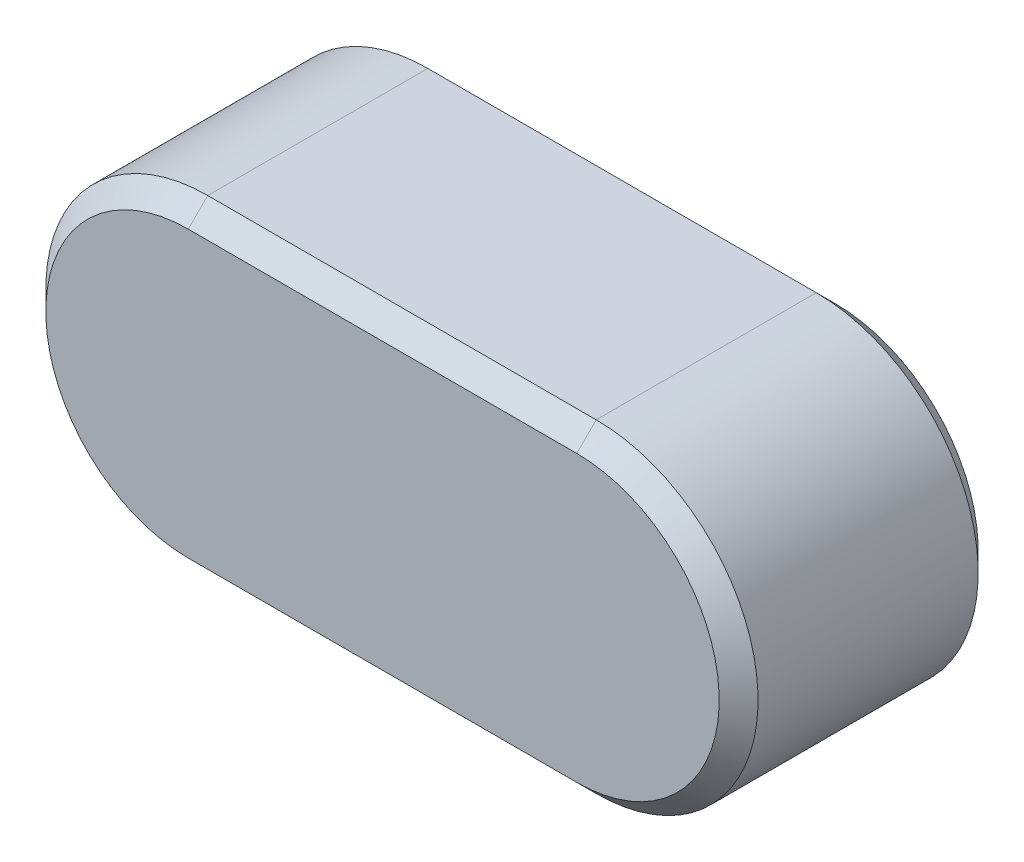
ISO-10303-21;
HEADER;
FILE_DESCRIPTION(('STEP AP214'),'2;1');
FILE_NAME('part.step','',(''),(''),'','','');
FILE_SCHEMA(('AUTOMOTIVE_DESIGN { 1 0 10303 214 1 1 1 1 }'));
ENDSEC;
DATA;
#1=APPLICATION_CONTEXT('core data for automotive mechanical design processes');
#2=APPLICATION_PROTOCOL_DEFINITION('international standard','automotive_design',2000,#1);
#3=PRODUCT_CONTEXT('',#1,'mechanical');
#4=PRODUCT('Part','Part','',(#3));
#5=PRODUCT_RELATED_PRODUCT_CATEGORY('part','',(#4));
#6=PRODUCT_DEFINITION_FORMATION('','',#4);
#7=PRODUCT_DEFINITION_CONTEXT('part definition',#1,'design');
#8=PRODUCT_DEFINITION('design','',#6,#7);
#9=PRODUCT_DEFINITION_SHAPE('','',#8);
#10=(LENGTH_UNIT() NAMED_UNIT(*) SI_UNIT(.MILLI.,.METRE.));
#11=(NAMED_UNIT(*) PLANE_ANGLE_UNIT() SI_UNIT($,.RADIAN.));
#12=(NAMED_UNIT(*) SI_UNIT($,.STERADIAN.) SOLID_ANGLE_UNIT());
#13=UNCERTAINTY_MEASURE_WITH_UNIT(LENGTH_MEASURE(1.E-05),#10,'distance_accuracy_value','');
#14=(GEOMETRIC_REPRESENTATION_CONTEXT(3) GLOBAL_UNCERTAINTY_ASSIGNED_CONTEXT((#13)) GLOBAL_UNIT_ASSIGNED_CONTEXT((#10,
#11,#12)) REPRESENTATION_CONTEXT('',''));
#15=CARTESIAN_POINT('',(0.,0.,0.));
#16=DIRECTION('',(0.,0.,1.));
#17=DIRECTION('',(1.,0.,0.));
#18=AXIS2_PLACEMENT_3D('',#15,#16,#17);
#19=CARTESIAN_POINT('',(8.04911692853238E-13,4.99999999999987,8.00000000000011));
#20=DIRECTION('',(0.,0.,-1.00000000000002));
#21=DIRECTION('',(-1.,0.,0.));
#22=AXIS2_PLACEMENT_3D('',#19,#20,#21);
#23=CYLINDRICAL_SURFACE('',#22,5.);
#24=DIRECTION('',(0.,0.,-1.00000000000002));
#25=VECTOR('',#24,1.);
#26=CARTESIAN_POINT('',(8.88178419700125E-13,-1.0321604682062E-13,8.00000000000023));
#27=LINE('',#26,#25);
#28=CARTESIAN_POINT('',(8.88178419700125E-13,0.,7.40000000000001));
#29=VERTEX_POINT('',#28);
#30=CARTESIAN_POINT('',(4.16333634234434E-13,0.,0.600000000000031));
#31=VERTEX_POINT('',#30);
#32=EDGE_CURVE('E101',#29,#31,#27,.T.);
#33=ORIENTED_EDGE('',*,*,#32,.F.);
#34=CARTESIAN_POINT('',(8.88178419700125E-13,4.99999999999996,7.40000000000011));
#35=DIRECTION('',(0.,0.,-1.00000000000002));
#36=DIRECTION('',(-1.,0.,0.));
#37=AXIS2_PLACEMENT_3D('',#34,#35,#36);
#38=CIRCLE('',#37,5.);
#39=CARTESIAN_POINT('',(8.88178419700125E-13,9.99999999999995,7.40000000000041));
#40=VERTEX_POINT('',#39);
#41=EDGE_CURVE('E125',#29,#40,#38,.T.);
#42=ORIENTED_EDGE('',*,*,#41,.T.);
#43=DIRECTION('',(0.,0.,-1.00000000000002));
#44=VECTOR('',#43,1.);
#45=CARTESIAN_POINT('',(8.04911692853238E-13,10.0000000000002,8.00000000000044));
#46=LINE('',#45,#44);
#47=CARTESIAN_POINT('',(8.88178419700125E-13,9.99999999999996,0.599999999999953));
#48=VERTEX_POINT('',#47);
#49=EDGE_CURVE('E136',#40,#48,#46,.T.);
#50=ORIENTED_EDGE('',*,*,#49,.T.);
#51=CARTESIAN_POINT('',(8.88178419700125E-13,4.99999999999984,0.600000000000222));
#52=DIRECTION('',(0.,0.,-1.00000000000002));
#53=DIRECTION('',(-1.,0.,0.));
#54=AXIS2_PLACEMENT_3D('',#51,#52,#53);
#55=CIRCLE('',#54,5.);
#56=EDGE_CURVE('E123',#48,#31,#55,.F.);
#57=ORIENTED_EDGE('',*,*,#56,.T.);
#58=EDGE_LOOP('',(#33,#42,#50,#57));
#59=FACE_BOUND('',#58,.T.);
#60=ADVANCED_FACE('F16',(#59),#23,.T.);
#61=CARTESIAN_POINT('',(8.88178419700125E-13,-1.0321604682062E-13,8.00000000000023));
#62=DIRECTION('',(0.,1.00000000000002,0.));
#63=DIRECTION('',(0.,0.,1.00000000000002));
#64=AXIS2_PLACEMENT_3D('',#61,#62,#63);
#65=PLANE('',#64);
#66=DIRECTION('',(0.,0.,-1.00000000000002));
#67=VECTOR('',#66,1.);
#68=CARTESIAN_POINT('',(12.0000000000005,0.,7.9999999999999));
#69=LINE('',#68,#67);
#70=CARTESIAN_POINT('',(12.0000000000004,0.,7.4));
#71=VERTEX_POINT('',#70);
#72=CARTESIAN_POINT('',(12.,0.,0.599999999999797));
#73=VERTEX_POINT('',#72);
#74=EDGE_CURVE('E255',#71,#73,#69,.T.);
#75=ORIENTED_EDGE('',*,*,#74,.F.);
#76=DIRECTION('',(-1.,0.,0.));
#77=VECTOR('',#76,1.);
#78=CARTESIAN_POINT('',(8.88178419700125E-13,0.,7.40000000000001));
#79=LINE('',#78,#77);
#80=EDGE_CURVE('E121',#71,#29,#79,.T.);
#81=ORIENTED_EDGE('',*,*,#80,.T.);
#82=ORIENTED_EDGE('',*,*,#32,.T.);
#83=DIRECTION('',(1.,0.,0.));
#84=VECTOR('',#83,1.);
#85=CARTESIAN_POINT('',(12.,0.,0.599999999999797));
#86=LINE('',#85,#84);
#87=EDGE_CURVE('E118',#31,#73,#86,.T.);
#88=ORIENTED_EDGE('',*,*,#87,.T.);
#89=EDGE_LOOP('',(#75,#81,#82,#88));
#90=FACE_BOUND('',#89,.T.);
#91=ADVANCED_FACE('F174',(#90),#65,.F.);
#92=CARTESIAN_POINT('',(12.0000000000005,5.0000000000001,8.00000000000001));
#93=DIRECTION('',(0.,0.,-1.00000000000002));
#94=DIRECTION('',(-1.,0.,0.));
#95=AXIS2_PLACEMENT_3D('',#92,#93,#94);
#96=CYLINDRICAL_SURFACE('',#95,5.);
#97=DIRECTION('',(0.,0.,-1.00000000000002));
#98=VECTOR('',#97,1.);
#99=CARTESIAN_POINT('',(12.0000000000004,10.0000000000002,7.99999999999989));
#100=LINE('',#99,#98);
#101=CARTESIAN_POINT('',(12.0000000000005,10.0000000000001,7.3999999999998));
#102=VERTEX_POINT('',#101);
#103=CARTESIAN_POINT('',(12.0000000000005,10.0000000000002,0.599999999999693));
#104=VERTEX_POINT('',#103);
#105=EDGE_CURVE('E251',#102,#104,#100,.T.);
#106=ORIENTED_EDGE('',*,*,#105,.F.);
#107=CARTESIAN_POINT('',(12.0000000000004,4.99999999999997,7.39999999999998));
#108=DIRECTION('',(0.,0.,-1.00000000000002));
#109=DIRECTION('',(-1.,0.,0.));
#110=AXIS2_PLACEMENT_3D('',#107,#108,#109);
#111=CIRCLE('',#110,5.);
#112=EDGE_CURVE('E116',#102,#71,#111,.T.);
#113=ORIENTED_EDGE('',*,*,#112,.T.);
#114=ORIENTED_EDGE('',*,*,#74,.T.);
#115=CARTESIAN_POINT('',(12.0000000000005,4.99999999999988,0.599999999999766));
#116=DIRECTION('',(0.,0.,-1.00000000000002));
#117=DIRECTION('',(-1.,0.,0.));
#118=AXIS2_PLACEMENT_3D('',#115,#116,#117);
#119=CIRCLE('',#118,5.);
#120=EDGE_CURVE('E114',#73,#104,#119,.F.);
#121=ORIENTED_EDGE('',*,*,#120,.T.);
#122=EDGE_LOOP('',(#106,#113,#114,#121));
#123=FACE_BOUND('',#122,.T.);
#124=ADVANCED_FACE('F180',(#123),#96,.T.);
#125=CARTESIAN_POINT('',(8.04911692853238E-13,10.0000000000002,8.00000000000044));
#126=DIRECTION('',(0.,-1.00000000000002,0.));
#127=DIRECTION('',(0.,0.,-1.00000000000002));
#128=AXIS2_PLACEMENT_3D('',#125,#126,#127);
#129=PLANE('',#128);
#130=ORIENTED_EDGE('',*,*,#49,.F.);
#131=DIRECTION('',(1.,0.,0.));
#132=VECTOR('',#131,1.);
#133=CARTESIAN_POINT('',(8.88178419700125E-13,9.99999999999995,7.40000000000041));
#134=LINE('',#133,#132);
#135=EDGE_CURVE('E88',#40,#102,#134,.T.);
#136=ORIENTED_EDGE('',*,*,#135,.T.);
#137=ORIENTED_EDGE('',*,*,#105,.T.);
#138=DIRECTION('',(-1.,0.,0.));
#139=VECTOR('',#138,1.);
#140=CARTESIAN_POINT('',(8.88178419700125E-13,9.99999999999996,0.599999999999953));
#141=LINE('',#140,#139);
#142=EDGE_CURVE('E107',#104,#48,#141,.T.);
#143=ORIENTED_EDGE('',*,*,#142,.T.);
#144=EDGE_LOOP('',(#130,#136,#137,#143));
#145=FACE_BOUND('',#144,.T.);
#146=ADVANCED_FACE('F170',(#145),#129,.F.);
#147=CARTESIAN_POINT('',(8.04911692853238E-13,4.99999999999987,8.00000000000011));
#148=DIRECTION('',(0.,0.,-1.00000000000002));
#149=DIRECTION('',(-1.,0.,0.));
#150=AXIS2_PLACEMENT_3D('',#147,#148,#149);
#151=PLANE('',#150);
#152=CARTESIAN_POINT('',(12.0000000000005,5.0000000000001,8.00000000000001));
#153=DIRECTION('',(0.,0.,-1.00000000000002));
#154=DIRECTION('',(-1.,0.,0.));
#155=AXIS2_PLACEMENT_3D('',#152,#153,#154);
#156=CIRCLE('',#155,4.4);
#157=CARTESIAN_POINT('',(12.0000000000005,0.600000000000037,7.99999999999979));
#158=VERTEX_POINT('',#157);
#159=CARTESIAN_POINT('',(12.0000000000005,9.40000000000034,7.99999999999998));
#160=VERTEX_POINT('',#159);
#161=EDGE_CURVE('E105',#158,#160,#156,.F.);
#162=ORIENTED_EDGE('',*,*,#161,.T.);
#163=DIRECTION('',(-1.,0.,0.));
#164=VECTOR('',#163,1.);
#165=CARTESIAN_POINT('',(8.88178419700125E-13,9.40000000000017,8.00000000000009));
#166=LINE('',#165,#164);
#167=CARTESIAN_POINT('',(8.88178419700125E-13,9.40000000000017,8.00000000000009));
#168=VERTEX_POINT('',#167);
#169=EDGE_CURVE('E86',#160,#168,#166,.T.);
#170=ORIENTED_EDGE('',*,*,#169,.T.);
#171=CARTESIAN_POINT('',(8.04911692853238E-13,4.99999999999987,8.00000000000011));
#172=DIRECTION('',(0.,0.,-1.00000000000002));
#173=DIRECTION('',(-1.,0.,0.));
#174=AXIS2_PLACEMENT_3D('',#171,#172,#173);
#175=CIRCLE('',#174,4.4);
#176=CARTESIAN_POINT('',(8.88178419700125E-13,0.599999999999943,8.));
#177=VERTEX_POINT('',#176);
#178=EDGE_CURVE('E94',#168,#177,#175,.F.);
#179=ORIENTED_EDGE('',*,*,#178,.T.);
#180=DIRECTION('',(1.,0.,0.));
#181=VECTOR('',#180,1.);
#182=CARTESIAN_POINT('',(8.88178419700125E-13,0.600000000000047,7.99999999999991));
#183=LINE('',#182,#181);
#184=EDGE_CURVE('E100',#177,#158,#183,.T.);
#185=ORIENTED_EDGE('',*,*,#184,.T.);
#186=EDGE_LOOP('',(#162,#170,#179,#185));
#187=FACE_BOUND('',#186,.T.);
#188=ADVANCED_FACE('F103',(#187),#151,.F.);
#189=CARTESIAN_POINT('',(8.88178419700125E-13,4.99999999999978,1.45716771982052E-13));
#190=DIRECTION('',(0.,0.,-1.00000000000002));
#191=DIRECTION('',(-1.,0.,0.));
#192=AXIS2_PLACEMENT_3D('',#189,#190,#191);
#193=PLANE('',#192);
#194=CARTESIAN_POINT('',(12.0000000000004,4.99999999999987,-1.92554305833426E-13));
#195=DIRECTION('',(0.,0.,-1.00000000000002));
#196=DIRECTION('',(-1.,0.,0.));
#197=AXIS2_PLACEMENT_3D('',#194,#195,#196);
#198=CIRCLE('',#197,4.4);
#199=CARTESIAN_POINT('',(12.0000000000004,9.40000000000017,-2.65412691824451E-13));
#200=VERTEX_POINT('',#199);
#201=CARTESIAN_POINT('',(12.0000000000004,0.599999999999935,-2.02962646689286E-13));
#202=VERTEX_POINT('',#201);
#203=EDGE_CURVE('E25',#200,#202,#198,.T.);
#204=ORIENTED_EDGE('',*,*,#203,.T.);
#205=DIRECTION('',(-1.,0.,0.));
#206=VECTOR('',#205,1.);
#207=CARTESIAN_POINT('',(8.60422844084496E-13,0.599999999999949,0.));
#208=LINE('',#207,#206);
#209=CARTESIAN_POINT('',(8.60422844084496E-13,0.599999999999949,0.));
#210=VERTEX_POINT('',#209);
#211=EDGE_CURVE('E11',#202,#210,#208,.T.);
#212=ORIENTED_EDGE('',*,*,#211,.T.);
#213=CARTESIAN_POINT('',(8.88178419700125E-13,4.99999999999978,1.45716771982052E-13));
#214=DIRECTION('',(0.,0.,-1.00000000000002));
#215=DIRECTION('',(-1.,0.,0.));
#216=AXIS2_PLACEMENT_3D('',#213,#214,#215);
#217=CIRCLE('',#216,4.4);
#218=CARTESIAN_POINT('',(8.88178419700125E-13,9.40000000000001,-1.09287578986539E-13));
#219=VERTEX_POINT('',#218);
#220=EDGE_CURVE('E127',#210,#219,#217,.T.);
#221=ORIENTED_EDGE('',*,*,#220,.T.);
#222=DIRECTION('',(1.,0.,0.));
#223=VECTOR('',#222,1.);
#224=CARTESIAN_POINT('',(12.0000000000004,9.40000000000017,-2.65412691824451E-13));
#225=LINE('',#224,#223);
#226=EDGE_CURVE('E36',#219,#200,#225,.T.);
#227=ORIENTED_EDGE('',*,*,#226,.T.);
#228=EDGE_LOOP('',(#204,#212,#221,#227));
#229=FACE_BOUND('',#228,.T.);
#230=ADVANCED_FACE('F158',(#229),#193,.T.);
#231=CARTESIAN_POINT('',(8.88178419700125E-13,0.600000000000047,7.99999999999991));
#232=DIRECTION('',(0.,0.707106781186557,-0.707106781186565));
#233=DIRECTION('',(0.,0.707106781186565,0.707106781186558));
#234=AXIS2_PLACEMENT_3D('',#231,#232,#233);
#235=PLANE('',#234);
#236=DIRECTION('',(0.,0.707106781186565,0.707106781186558));
#237=VECTOR('',#236,1.);
#238=CARTESIAN_POINT('',(8.88178419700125E-13,0.,7.40000000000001));
#239=LINE('',#238,#237);
#240=EDGE_CURVE('E97',#29,#177,#239,.T.);
#241=ORIENTED_EDGE('',*,*,#240,.F.);
#242=ORIENTED_EDGE('',*,*,#80,.F.);
#243=DIRECTION('',(0.,-0.707106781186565,-0.707106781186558));
#244=VECTOR('',#243,1.);
#245=CARTESIAN_POINT('',(12.0000000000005,0.600000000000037,7.99999999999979));
#246=LINE('',#245,#244);
#247=EDGE_CURVE('E133',#158,#71,#246,.T.);
#248=ORIENTED_EDGE('',*,*,#247,.F.);
#249=ORIENTED_EDGE('',*,*,#184,.F.);
#250=EDGE_LOOP('',(#241,#242,#248,#249));
#251=FACE_BOUND('',#250,.T.);
#252=ADVANCED_FACE('F160',(#251),#235,.F.);
#253=CARTESIAN_POINT('',(12.0000000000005,5.0000000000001,8.00000000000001));
#254=DIRECTION('',(0.,0.,-1.00000000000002));
#255=DIRECTION('',(-1.,0.,0.));
#256=AXIS2_PLACEMENT_3D('',#253,#254,#255);
#257=CONICAL_SURFACE('',#256,4.4,0.785398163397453);
#258=ORIENTED_EDGE('',*,*,#247,.T.);
#259=ORIENTED_EDGE('',*,*,#112,.F.);
#260=DIRECTION('',(0.,0.707106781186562,-0.707106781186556));
#261=VECTOR('',#260,1.);
#262=CARTESIAN_POINT('',(12.0000000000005,9.40000000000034,7.99999999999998));
#263=LINE('',#262,#261);
#264=EDGE_CURVE('E91',#160,#102,#263,.T.);
#265=ORIENTED_EDGE('',*,*,#264,.F.);
#266=ORIENTED_EDGE('',*,*,#161,.F.);
#267=EDGE_LOOP('',(#258,#259,#265,#266));
#268=FACE_BOUND('',#267,.T.);
#269=ADVANCED_FACE('F167',(#268),#257,.T.);
#270=CARTESIAN_POINT('',(8.04911692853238E-13,4.99999999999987,8.00000000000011));
#271=DIRECTION('',(0.,0.,-1.00000000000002));
#272=DIRECTION('',(-1.,0.,0.));
#273=AXIS2_PLACEMENT_3D('',#270,#271,#272);
#274=CONICAL_SURFACE('',#273,4.4,0.785398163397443);
#275=ORIENTED_EDGE('',*,*,#240,.T.);
#276=ORIENTED_EDGE('',*,*,#178,.F.);
#277=DIRECTION('',(0.,-0.707106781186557,0.707106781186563));
#278=VECTOR('',#277,1.);
#279=CARTESIAN_POINT('',(8.88178419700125E-13,9.99999999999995,7.40000000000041));
#280=LINE('',#279,#278);
#281=EDGE_CURVE('E82',#40,#168,#280,.T.);
#282=ORIENTED_EDGE('',*,*,#281,.F.);
#283=ORIENTED_EDGE('',*,*,#41,.F.);
#284=EDGE_LOOP('',(#275,#276,#282,#283));
#285=FACE_BOUND('',#284,.T.);
#286=ADVANCED_FACE('F95',(#285),#274,.T.);
#287=CARTESIAN_POINT('',(8.88178419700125E-13,9.40000000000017,8.00000000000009));
#288=DIRECTION('',(0.,-0.707106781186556,-0.707106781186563));
#289=DIRECTION('',(0.,0.707106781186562,-0.707106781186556));
#290=AXIS2_PLACEMENT_3D('',#287,#288,#289);
#291=PLANE('',#290);
#292=ORIENTED_EDGE('',*,*,#264,.T.);
#293=ORIENTED_EDGE('',*,*,#135,.F.);
#294=ORIENTED_EDGE('',*,*,#281,.T.);
#295=ORIENTED_EDGE('',*,*,#169,.F.);
#296=EDGE_LOOP('',(#292,#293,#294,#295));
#297=FACE_BOUND('',#296,.T.);
#298=ADVANCED_FACE('F84',(#297),#291,.F.);
#299=CARTESIAN_POINT('',(8.88178419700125E-13,9.99999999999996,0.599999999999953));
#300=DIRECTION('',(0.,0.707106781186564,-0.707106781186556));
#301=DIRECTION('',(0.,0.707106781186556,0.707106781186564));
#302=AXIS2_PLACEMENT_3D('',#299,#300,#301);
#303=PLANE('',#302);
#304=DIRECTION('',(0.,0.707106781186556,0.707106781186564));
#305=VECTOR('',#304,1.);
#306=CARTESIAN_POINT('',(12.0000000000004,9.40000000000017,-2.65412691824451E-13));
#307=LINE('',#306,#305);
#308=EDGE_CURVE('E140',#200,#104,#307,.T.);
#309=ORIENTED_EDGE('',*,*,#308,.F.);
#310=ORIENTED_EDGE('',*,*,#226,.F.);
#311=DIRECTION('',(0.,-0.707106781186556,-0.707106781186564));
#312=VECTOR('',#311,1.);
#313=CARTESIAN_POINT('',(8.88178419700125E-13,9.99999999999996,0.599999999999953));
#314=LINE('',#313,#312);
#315=EDGE_CURVE('E20',#48,#219,#314,.T.);
#316=ORIENTED_EDGE('',*,*,#315,.F.);
#317=ORIENTED_EDGE('',*,*,#142,.F.);
#318=EDGE_LOOP('',(#309,#310,#316,#317));
#319=FACE_BOUND('',#318,.T.);
#320=ADVANCED_FACE('F18',(#319),#303,.T.);
#321=CARTESIAN_POINT('',(8.88178419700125E-13,4.99999999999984,0.600000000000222));
#322=DIRECTION('',(0.,0.,1.00000000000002));
#323=DIRECTION('',(1.,0.,0.));
#324=AXIS2_PLACEMENT_3D('',#321,#322,#323);
#325=CONICAL_SURFACE('',#324,5.,0.785398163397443);
#326=ORIENTED_EDGE('',*,*,#315,.T.);
#327=ORIENTED_EDGE('',*,*,#220,.F.);
#328=DIRECTION('',(0.,0.707106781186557,-0.707106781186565));
#329=VECTOR('',#328,1.);
#330=CARTESIAN_POINT('',(4.16333634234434E-13,0.,0.600000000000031));
#331=LINE('',#330,#329);
#332=EDGE_CURVE('E139',#31,#210,#331,.T.);
#333=ORIENTED_EDGE('',*,*,#332,.F.);
#334=ORIENTED_EDGE('',*,*,#56,.F.);
#335=EDGE_LOOP('',(#326,#327,#333,#334));
#336=FACE_BOUND('',#335,.T.);
#337=ADVANCED_FACE('F149',(#336),#325,.T.);
#338=CARTESIAN_POINT('',(12.0000000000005,4.99999999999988,0.599999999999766));
#339=DIRECTION('',(0.,0.,1.00000000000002));
#340=DIRECTION('',(1.,0.,0.));
#341=AXIS2_PLACEMENT_3D('',#338,#339,#340);
#342=CONICAL_SURFACE('',#341,5.,0.785398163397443);
#343=ORIENTED_EDGE('',*,*,#308,.T.);
#344=ORIENTED_EDGE('',*,*,#120,.F.);
#345=DIRECTION('',(0.,-0.707106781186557,0.707106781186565));
#346=VECTOR('',#345,1.);
#347=CARTESIAN_POINT('',(12.0000000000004,0.599999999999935,-2.02962646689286E-13));
#348=LINE('',#347,#346);
#349=EDGE_CURVE('E137',#202,#73,#348,.T.);
#350=ORIENTED_EDGE('',*,*,#349,.F.);
#351=ORIENTED_EDGE('',*,*,#203,.F.);
#352=EDGE_LOOP('',(#343,#344,#350,#351));
#353=FACE_BOUND('',#352,.T.);
#354=ADVANCED_FACE('F154',(#353),#342,.T.);
#355=CARTESIAN_POINT('',(4.16333634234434E-13,0.,0.600000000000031));
#356=DIRECTION('',(0.,-0.707106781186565,-0.707106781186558));
#357=DIRECTION('',(0.,0.707106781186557,-0.707106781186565));
#358=AXIS2_PLACEMENT_3D('',#355,#356,#357);
#359=PLANE('',#358);
#360=ORIENTED_EDGE('',*,*,#332,.T.);
#361=ORIENTED_EDGE('',*,*,#211,.F.);
#362=ORIENTED_EDGE('',*,*,#349,.T.);
#363=ORIENTED_EDGE('',*,*,#87,.F.);
#364=EDGE_LOOP('',(#360,#361,#362,#363));
#365=FACE_BOUND('',#364,.T.);
#366=ADVANCED_FACE('F157',(#365),#359,.T.);
#367=CLOSED_SHELL('',(#60,#91,#124,#146,#188,#230,#252,#269,#286,#298,#320,#337,#354,#366));
#368=MANIFOLD_SOLID_BREP('B1',#367);
#369=ADVANCED_BREP_SHAPE_REPRESENTATION('',(#18,#368),#14);
#370=SHAPE_DEFINITION_REPRESENTATION(#9,#369);
ENDSEC;
END-ISO-10303-21;
